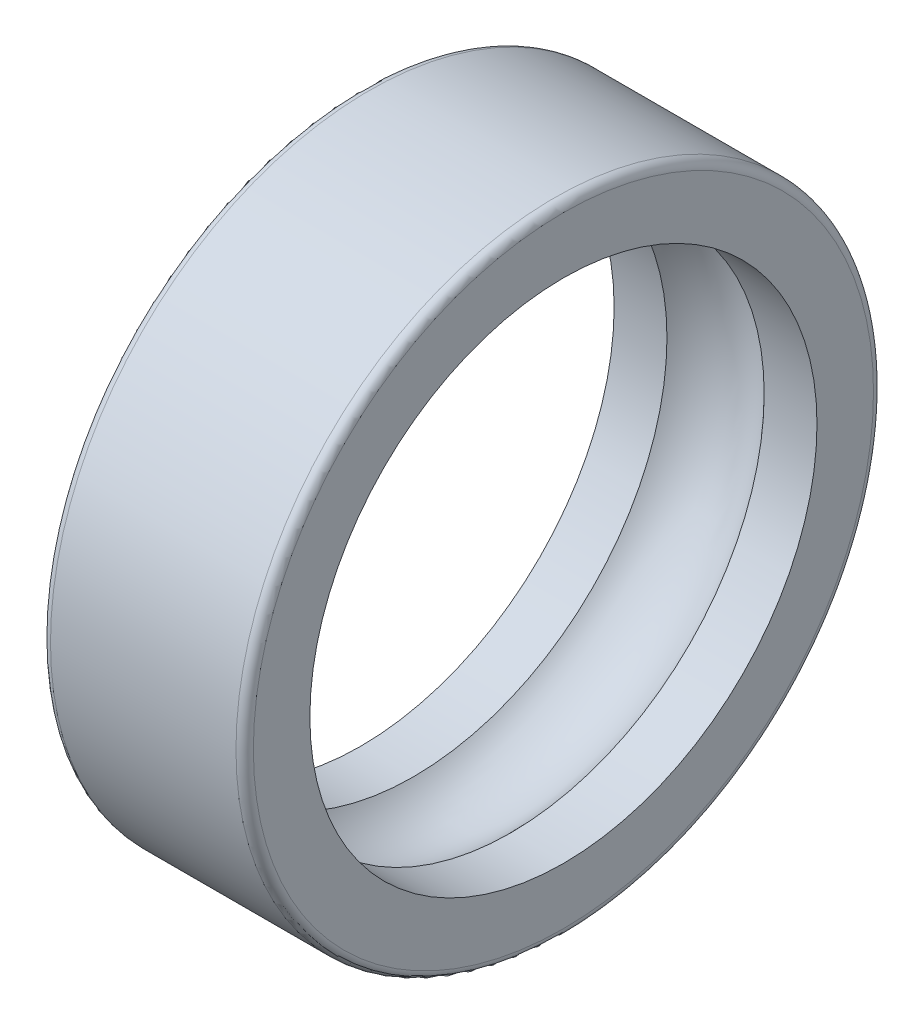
from build123d import *


with BuildPart() as part:
    # Esquisse1 → Base-R_volution (revolve)
    with BuildSketch(Plane(origin=(0, 0, 0), x_dir=(1, 0, 0), z_dir=(0, 1, 0)), mode=Mode.PRIVATE) as base_r_volution_sk:
        with BuildLine():
            Line((0, 10.7), (0, 8.75))
            Line((0, 8.75), (1.822949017, 8.75))
            ThreePointArc((1.822949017, 8.75), (3.5, 9.5), (5.177050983, 8.75))
            Line((5.177050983, 8.75), (7, 8.75))
            Line((7, 8.75), (7, 10.7))
            ThreePointArc((7, 10.7), (6.912132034, 10.912132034), (6.7, 11))
            Line((6.7, 11), (0.3, 11))
            ThreePointArc((0.3, 11), (0.087867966, 10.912132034), (0, 10.7))
        make_face()
    revolve(base_r_volution_sk.sketch.rotate(Axis((0, 0, 0), (1, 0, 0)), 180), axis=Axis((0, 0, 0), (1, 0, 0)))


solid = part.part
